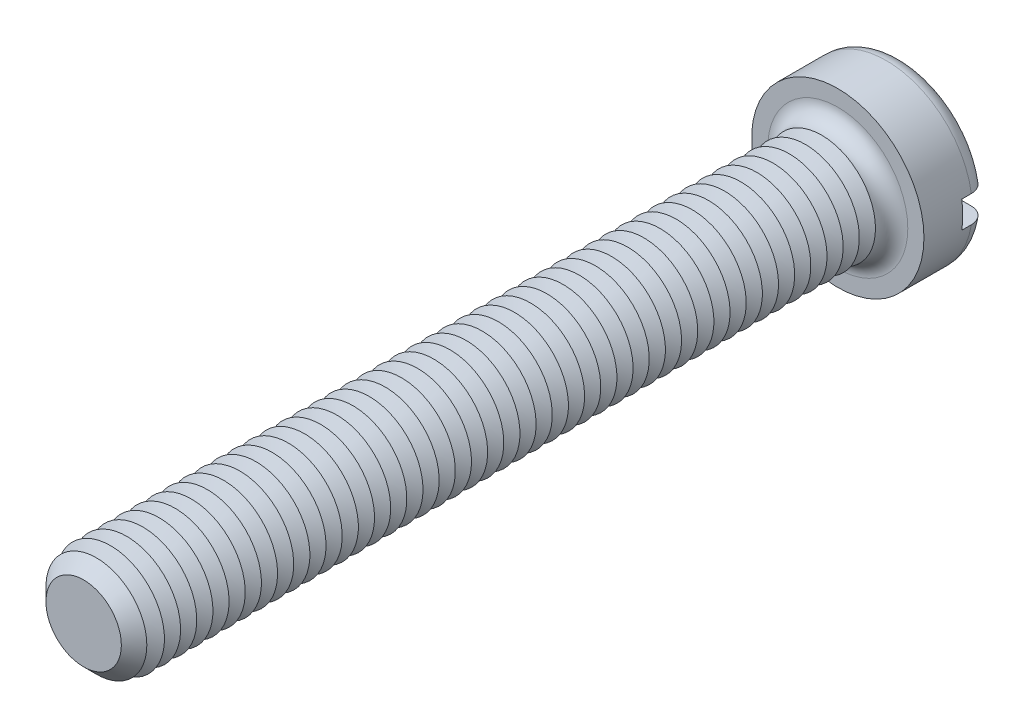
from build123d import *

# Parameters (mm, degrees)
SKETCH3_R           = 8
BOSS_EXTRUDE2_DEPTH = 6
SKETCH4_R           = 5
BOSS_EXTRUDE3_DEPTH = 70
FILLET1_R           = 1.5
CHAMFER1_SIZE       = 1.5
LPATTERN1_COUNT     = 45
LPATTERN1_PITCH     = 1.5
SKETCH8_W           = 16
SKETCH8_H           = 2.5
CUT_EXTRUDE1_DEPTH  = 2.4


with BuildPart() as part:
    # Sketch3 → Boss-Extrude2 (new body)
    with BuildSketch(Plane.XY):
        Circle(SKETCH3_R)
    extrude(amount=-BOSS_EXTRUDE2_DEPTH)

    # Sketch4 → Boss-Extrude3 (add)
    with BuildSketch(Plane.XY):
        Circle(SKETCH4_R)
    extrude(amount=BOSS_EXTRUDE3_DEPTH)

    # Fillet1
    fillet1_edges = [part.edges().sort_by_distance(p)[0] for p in [
        (-8, 0, -6),
        (-5, 0, 0),
    ]]
    fillet(fillet1_edges, radius=FILLET1_R)

    # Chamfer1
    chamfer1_edges = [part.edges().sort_by_distance(p)[0] for p in [
        (-5, 0, 70),
    ]]
    chamfer(chamfer1_edges, length=CHAMFER1_SIZE)

    # Sketch6 → Cut-Revolve1 (revolve, cut)
    with BuildSketch(Plane(origin=(0, 0, 0), x_dir=(0, 0, -1), z_dir=(1, 0, 0)), mode=Mode.PRIVATE) as cut_revolve1_sk:
        Polygon((-1.5, 5), (-2.25, 3.700961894), (-3, 5), align=None)
    cut_revolve1 = revolve(cut_revolve1_sk.sketch.rotate(Axis((0, 0, -1.694361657), (0, 0, 1)), 90), axis=Axis((0, 0, -1.694361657), (0, 0, 1)), mode=Mode.SUBTRACT)

    # LPattern1: Cut-Revolve1 ×45
    with Locations(*[(0, 0, i * LPATTERN1_PITCH) for i in range(1, LPATTERN1_COUNT)]):
        add(cut_revolve1, mode=Mode.SUBTRACT)

    # Sketch8 → Cut-Extrude1 (cut)
    with BuildSketch(Plane(origin=(0, 0, -6), x_dir=(-1, 0, 0), z_dir=(0, 0, -1))):
        Rectangle(SKETCH8_W, SKETCH8_H)
    extrude(amount=-CUT_EXTRUDE1_DEPTH, mode=Mode.SUBTRACT)


solid = part.part
